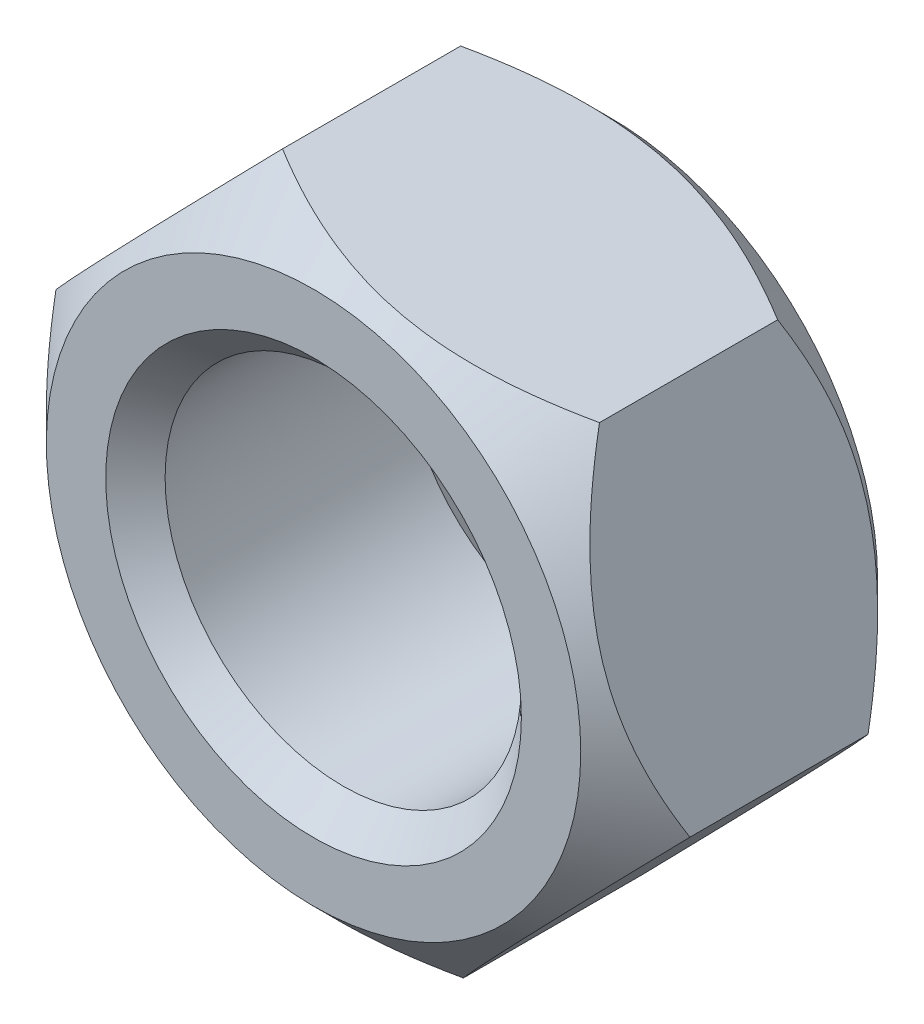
ISO-10303-21;
HEADER;
FILE_DESCRIPTION(('STEP AP214'),'2;1');
FILE_NAME('part.step','',(''),(''),'','','');
FILE_SCHEMA(('AUTOMOTIVE_DESIGN { 1 0 10303 214 1 1 1 1 }'));
ENDSEC;
DATA;
#1=APPLICATION_CONTEXT('core data for automotive mechanical design processes');
#2=APPLICATION_PROTOCOL_DEFINITION('international standard','automotive_design',2000,#1);
#3=PRODUCT_CONTEXT('',#1,'mechanical');
#4=PRODUCT('Part','Part','',(#3));
#5=PRODUCT_RELATED_PRODUCT_CATEGORY('part','',(#4));
#6=PRODUCT_DEFINITION_FORMATION('','',#4);
#7=PRODUCT_DEFINITION_CONTEXT('part definition',#1,'design');
#8=PRODUCT_DEFINITION('design','',#6,#7);
#9=PRODUCT_DEFINITION_SHAPE('','',#8);
#10=(LENGTH_UNIT() NAMED_UNIT(*) SI_UNIT(.MILLI.,.METRE.));
#11=(NAMED_UNIT(*) PLANE_ANGLE_UNIT() SI_UNIT($,.RADIAN.));
#12=(NAMED_UNIT(*) SI_UNIT($,.STERADIAN.) SOLID_ANGLE_UNIT());
#13=UNCERTAINTY_MEASURE_WITH_UNIT(LENGTH_MEASURE(1.E-05),#10,'distance_accuracy_value','');
#14=(GEOMETRIC_REPRESENTATION_CONTEXT(3) GLOBAL_UNCERTAINTY_ASSIGNED_CONTEXT((#13)) GLOBAL_UNIT_ASSIGNED_CONTEXT((#10,
#11,#12)) REPRESENTATION_CONTEXT('',''));
#15=CARTESIAN_POINT('',(0.,0.,0.));
#16=DIRECTION('',(0.,0.,1.));
#17=DIRECTION('',(1.,0.,0.));
#18=AXIS2_PLACEMENT_3D('',#15,#16,#17);
#19=CARTESIAN_POINT('',(0.,0.,5.));
#20=DIRECTION('',(0.,0.,1.));
#21=DIRECTION('',(1.,0.,0.));
#22=AXIS2_PLACEMENT_3D('',#19,#20,#21);
#23=PLANE('',#22);
#24=CARTESIAN_POINT('',(0.,0.,5.));
#25=DIRECTION('',(0.,0.,1.));
#26=DIRECTION('',(1.,0.,0.));
#27=AXIS2_PLACEMENT_3D('',#24,#25,#26);
#28=CIRCLE('',#27,3.50000000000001);
#29=CARTESIAN_POINT('',(3.50000000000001,0.,5.));
#30=VERTEX_POINT('',#29);
#31=EDGE_CURVE('E325',#30,#30,#28,.F.);
#32=ORIENTED_EDGE('',*,*,#31,.T.);
#33=EDGE_LOOP('',(#32));
#34=FACE_BOUND('',#33,.T.);
#35=CARTESIAN_POINT('',(0.,0.,5.));
#36=DIRECTION('',(0.,0.,1.));
#37=DIRECTION('',(1.,0.,0.));
#38=AXIS2_PLACEMENT_3D('',#35,#36,#37);
#39=CIRCLE('',#38,4.50000000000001);
#40=CARTESIAN_POINT('',(4.50000000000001,0.,5.));
#41=VERTEX_POINT('',#40);
#42=EDGE_CURVE('E116',#41,#41,#39,.T.);
#43=ORIENTED_EDGE('',*,*,#42,.T.);
#44=EDGE_LOOP('',(#43));
#45=FACE_BOUND('',#44,.T.);
#46=ADVANCED_FACE('F33',(#34,#45),#23,.T.);
#47=CARTESIAN_POINT('',(0.,0.,0.));
#48=DIRECTION('',(0.,0.,1.));
#49=DIRECTION('',(1.,0.,0.));
#50=AXIS2_PLACEMENT_3D('',#47,#48,#49);
#51=PLANE('',#50);
#52=CARTESIAN_POINT('',(0.,0.,0.));
#53=DIRECTION('',(0.,0.,1.));
#54=DIRECTION('',(1.,0.,0.));
#55=AXIS2_PLACEMENT_3D('',#52,#53,#54);
#56=CIRCLE('',#55,3.5);
#57=CARTESIAN_POINT('',(3.5,0.,0.));
#58=VERTEX_POINT('',#57);
#59=EDGE_CURVE('E46',#58,#58,#56,.T.);
#60=ORIENTED_EDGE('',*,*,#59,.T.);
#61=EDGE_LOOP('',(#60));
#62=FACE_BOUND('',#61,.T.);
#63=CARTESIAN_POINT('',(0.,0.,0.));
#64=DIRECTION('',(0.,0.,1.));
#65=DIRECTION('',(1.,0.,0.));
#66=AXIS2_PLACEMENT_3D('',#63,#64,#65);
#67=CIRCLE('',#66,4.5);
#68=CARTESIAN_POINT('',(4.5,0.,0.));
#69=VERTEX_POINT('',#68);
#70=EDGE_CURVE('E113',#69,#69,#67,.F.);
#71=ORIENTED_EDGE('',*,*,#70,.T.);
#72=EDGE_LOOP('',(#71));
#73=FACE_BOUND('',#72,.T.);
#74=ADVANCED_FACE('F137',(#62,#73),#51,.F.);
#75=CARTESIAN_POINT('',(0.,0.,5.));
#76=DIRECTION('',(0.,0.,-1.));
#77=DIRECTION('',(-1.,0.,0.));
#78=AXIS2_PLACEMENT_3D('',#75,#76,#77);
#79=CYLINDRICAL_SURFACE('',#78,3.);
#80=CARTESIAN_POINT('',(0.,0.,4.5));
#81=DIRECTION('',(0.,0.,1.));
#82=DIRECTION('',(1.,0.,0.));
#83=AXIS2_PLACEMENT_3D('',#80,#81,#82);
#84=CIRCLE('',#83,3.);
#85=CARTESIAN_POINT('',(3.,0.,4.5));
#86=VERTEX_POINT('',#85);
#87=EDGE_CURVE('E327',#86,#86,#84,.T.);
#88=ORIENTED_EDGE('',*,*,#87,.T.);
#89=EDGE_LOOP('',(#88));
#90=FACE_BOUND('',#89,.T.);
#91=CARTESIAN_POINT('',(0.,0.,0.500000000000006));
#92=DIRECTION('',(0.,0.,1.));
#93=DIRECTION('',(1.,0.,0.));
#94=AXIS2_PLACEMENT_3D('',#91,#92,#93);
#95=CIRCLE('',#94,3.);
#96=CARTESIAN_POINT('',(3.,0.,0.500000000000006));
#97=VERTEX_POINT('',#96);
#98=EDGE_CURVE('E324',#97,#97,#95,.F.);
#99=ORIENTED_EDGE('',*,*,#98,.T.);
#100=EDGE_LOOP('',(#99));
#101=FACE_BOUND('',#100,.T.);
#102=ADVANCED_FACE('F133',(#90,#101),#79,.F.);
#103=CARTESIAN_POINT('',(0.,0.,0.999999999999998));
#104=DIRECTION('',(0.,0.,1.));
#105=DIRECTION('',(1.,0.,0.));
#106=AXIS2_PLACEMENT_3D('',#103,#104,#105);
#107=CONICAL_SURFACE('',#106,5.5,0.78539816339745);
#108=CARTESIAN_POINT('',(-1.52271013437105,5.28516221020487,1.00014415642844));
#109=CARTESIAN_POINT('',(-1.52271258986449,5.28515966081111,1.00014238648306));
#110=CARTESIAN_POINT('',(-1.52271504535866,5.28515711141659,1.0001406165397));
#111=CARTESIAN_POINT('',(-1.65352527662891,5.14934457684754,0.90585150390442));
#112=CARTESIAN_POINT('',(-1.78640365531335,5.01138480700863,0.817315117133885));
#113=CARTESIAN_POINT('',(-2.05667600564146,4.73077699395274,0.655458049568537));
#114=CARTESIAN_POINT('',(-2.19407248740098,4.58812634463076,0.582145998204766));
#115=CARTESIAN_POINT('',(-2.47299281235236,4.29853985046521,0.455499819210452));
#116=CARTESIAN_POINT('',(-2.61450513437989,4.15161596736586,0.402114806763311));
#117=CARTESIAN_POINT('',(-2.82921866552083,3.92869159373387,0.340335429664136));
#118=CARTESIAN_POINT('',(-2.90117815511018,3.85398030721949,0.322794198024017));
#119=CARTESIAN_POINT('',(-3.04571296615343,3.70391835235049,0.29423996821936));
#120=CARTESIAN_POINT('',(-3.11828819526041,3.62856777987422,0.283226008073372));
#121=CARTESIAN_POINT('',(-3.29446119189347,3.44565776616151,0.264868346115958));
#122=CARTESIAN_POINT('',(-3.39824571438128,3.33790442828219,0.261026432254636));
#123=CARTESIAN_POINT('',(-3.60559009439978,3.12263100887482,0.267469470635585));
#124=CARTESIAN_POINT('',(-3.70914995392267,3.01511092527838,0.277754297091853));
#125=CARTESIAN_POINT('',(-3.91535768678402,2.80101761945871,0.311847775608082));
#126=CARTESIAN_POINT('',(-4.01800369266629,2.6944463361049,0.335679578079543));
#127=CARTESIAN_POINT('',(-4.22153557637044,2.48313120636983,0.395575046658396));
#128=CARTESIAN_POINT('',(-4.32242137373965,2.37838744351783,0.431639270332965));
#129=CARTESIAN_POINT('',(-4.58057298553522,2.11036387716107,0.538599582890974));
#130=CARTESIAN_POINT('',(-4.73623332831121,1.94875094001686,0.617522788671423));
#131=CARTESIAN_POINT('',(-5.04164745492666,1.63165749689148,0.795271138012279));
#132=CARTESIAN_POINT('',(-5.19140728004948,1.47617071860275,0.894075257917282));
#133=CARTESIAN_POINT('',(-5.33855506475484,1.32339586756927,1.0001406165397));
#134=CARTESIAN_POINT('',(-5.33855752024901,1.32339331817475,1.00014238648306));
#135=CARTESIAN_POINT('',(-5.33855997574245,1.32339076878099,1.00014415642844));
#136=B_SPLINE_CURVE_WITH_KNOTS('',3,(#108,#109,#110,#111,#112,#113,#114,#115,#116,#117,#118,
#119,#120,#121,#122,#123,#124,#125,#126,#127,#128,#129,#130,#131,#132,#133,#134,#135),
.UNSPECIFIED.,.F.,.F.,(4,2,2,2,2,2,2,2,2,2,2,2,2,4),(0.,1.18724079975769E-05,0.632472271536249,
1.26529018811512,1.89648093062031,2.21191086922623,2.52729430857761,2.9755633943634,
3.42382848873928,3.87286193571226,4.32191585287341,5.03411814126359,5.74557121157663,
5.74558308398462),.UNSPECIFIED.);
#137=CARTESIAN_POINT('',(-1.52291013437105,5.28495456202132,0.999999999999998));
#138=VERTEX_POINT('',#137);
#139=CARTESIAN_POINT('',(-5.33835997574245,1.32359841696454,0.999999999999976));
#140=VERTEX_POINT('',#139);
#141=EDGE_CURVE('E90',#138,#140,#136,.T.);
#142=ORIENTED_EDGE('',*,*,#141,.F.);
#143=CARTESIAN_POINT('',(3.81564984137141,3.96130655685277,1.00010303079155));
#144=CARTESIAN_POINT('',(3.72385953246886,3.98406513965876,0.952822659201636));
#145=CARTESIAN_POINT('',(3.63136367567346,4.00699865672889,0.906993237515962));
#146=CARTESIAN_POINT('',(3.44482244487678,4.05324987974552,0.818677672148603));
#147=CARTESIAN_POINT('',(3.35077625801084,4.07656778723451,0.776193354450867));
#148=CARTESIAN_POINT('',(3.06523083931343,4.14736620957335,0.654057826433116));
#149=CARTESIAN_POINT('',(2.87131430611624,4.19544607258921,0.580245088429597));
#150=CARTESIAN_POINT('',(2.48026609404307,4.29240296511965,0.453845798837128));
#151=CARTESIAN_POINT('',(2.28323436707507,4.34125521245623,0.400940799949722));
#152=CARTESIAN_POINT('',(1.98444746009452,4.41533674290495,0.33974266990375));
#153=CARTESIAN_POINT('',(1.88441192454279,4.44013965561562,0.322378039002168));
#154=CARTESIAN_POINT('',(1.6834938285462,4.48995549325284,0.294094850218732));
#155=CARTESIAN_POINT('',(1.58261139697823,4.51496838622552,0.283175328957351));
#156=CARTESIAN_POINT('',(1.33677615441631,4.57592102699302,0.264867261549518));
#157=CARTESIAN_POINT('',(1.19155846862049,4.61192644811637,0.261025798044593));
#158=CARTESIAN_POINT('',(0.901384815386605,4.68387239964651,0.267472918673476));
#159=CARTESIAN_POINT('',(0.756428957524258,4.71981290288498,0.27776645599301));
#160=CARTESIAN_POINT('',(0.46788384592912,4.79135507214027,0.311876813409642));
#161=CARTESIAN_POINT('',(0.324296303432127,4.82695631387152,0.335708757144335));
#162=CARTESIAN_POINT('',(0.0395891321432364,4.89754690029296,0.395600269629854));
#163=CARTESIAN_POINT('',(-0.101530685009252,4.93253629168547,0.431658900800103));
#164=CARTESIAN_POINT('',(-0.352046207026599,4.99464936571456,0.505843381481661));
#165=CARTESIAN_POINT('',(-0.461996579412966,5.02191057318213,0.542018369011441));
#166=CARTESIAN_POINT('',(-0.679923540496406,5.07594360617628,0.620197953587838));
#167=CARTESIAN_POINT('',(-0.78790006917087,5.1027154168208,0.662202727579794));
#168=CARTESIAN_POINT('',(-1.00153925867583,5.15568533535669,0.751100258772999));
#169=CARTESIAN_POINT('',(-1.10720799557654,5.18188494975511,0.797977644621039));
#170=CARTESIAN_POINT('',(-1.3165887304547,5.23379902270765,0.896004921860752));
#171=CARTESIAN_POINT('',(-1.42030188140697,5.25951376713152,0.947152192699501));
#172=CARTESIAN_POINT('',(-1.52311013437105,5.2850041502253,1.00010303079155));
#173=B_SPLINE_CURVE_WITH_KNOTS('',3,(#143,#144,#145,#146,#147,#148,#149,#150,#151,#152,#153,
#154,#155,#156,#157,#158,#159,#160,#161,#162,#163,#164,#165,#166,#167,#168,#169,#170,#171,#172),
.UNSPECIFIED.,.F.,.F.,(4,2,2,2,2,2,2,2,2,2,2,2,2,2,4),(0.,0.317171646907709,0.634515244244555,
1.27262866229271,1.90060920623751,2.21398358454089,2.52731110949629,2.9756055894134,
3.42405720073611,3.87301076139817,4.32192990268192,4.67850890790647,5.03509873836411,
5.3905959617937,5.74587658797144),.UNSPECIFIED.);
#174=CARTESIAN_POINT('',(3.81544984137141,3.96135614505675,1.00000000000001));
#175=VERTEX_POINT('',#174);
#176=EDGE_CURVE('E197',#175,#138,#173,.T.);
#177=ORIENTED_EDGE('',*,*,#176,.F.);
#178=CARTESIAN_POINT('',(5.33841760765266,-1.32379841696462,1.00010407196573));
#179=CARTESIAN_POINT('',(5.31223194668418,-1.2329263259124,0.952823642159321));
#180=CARTESIAN_POINT('',(5.28584500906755,-1.14135574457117,0.9069941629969));
#181=CARTESIAN_POINT('',(5.23262909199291,-0.956680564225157,0.818678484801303));
#182=CARTESIAN_POINT('',(5.2057998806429,-0.863575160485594,0.776194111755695));
#183=CARTESIAN_POINT('',(5.12434034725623,-0.580886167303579,0.654058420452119));
#184=CARTESIAN_POINT('',(5.06902042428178,-0.388909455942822,0.580245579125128));
#185=CARTESIAN_POINT('',(4.95746337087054,-0.00177304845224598,0.453846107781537));
#186=CARTESIAN_POINT('',(4.9012547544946,0.193287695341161,0.400941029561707));
#187=CARTESIAN_POINT('',(4.81601772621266,0.489085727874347,0.339742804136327));
#188=CARTESIAN_POINT('',(4.78747988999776,0.588120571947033,0.322378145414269));
#189=CARTESIAN_POINT('',(4.73016258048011,0.787028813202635,0.294094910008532));
#190=CARTESIAN_POINT('',(4.70138314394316,0.886902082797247,0.283175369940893));
#191=CARTESIAN_POINT('',(4.63125203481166,1.13027804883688,0.264867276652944));
#192=CARTESIAN_POINT('',(4.58982479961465,1.2740429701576,0.261025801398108));
#193=CARTESIAN_POINT('',(4.50704499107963,1.56131371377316,0.267472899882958));
#194=CARTESIAN_POINT('',(4.46569244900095,1.70481942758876,0.27776642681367));
#195=CARTESIAN_POINT('',(4.38337722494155,1.99047792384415,0.311876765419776));
#196=CARTESIAN_POINT('',(4.34241503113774,2.13262901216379,0.33570870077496));
#197=CARTESIAN_POINT('',(4.26119468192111,2.41448796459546,0.395600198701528));
#198=CARTESIAN_POINT('',(4.2209364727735,2.55419601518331,0.431658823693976));
#199=CARTESIAN_POINT('',(4.14947015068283,2.80220557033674,0.505843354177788));
#200=CARTESIAN_POINT('',(4.11810380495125,2.9110561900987,0.542018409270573));
#201=CARTESIAN_POINT('',(4.05593419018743,3.12680338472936,0.620198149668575));
#202=CARTESIAN_POINT('',(4.02513093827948,3.23369990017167,0.662203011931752));
#203=CARTESIAN_POINT('',(3.96418452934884,3.44520220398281,0.751100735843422));
#204=CARTESIAN_POINT('',(3.93403963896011,3.54981400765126,0.797978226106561));
#205=CARTESIAN_POINT('',(3.87430807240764,3.75710044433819,0.896005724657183));
#206=CARTESIAN_POINT('',(3.84472106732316,3.85977621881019,0.947153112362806));
#207=CARTESIAN_POINT('',(3.81539220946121,3.96155614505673,1.00010407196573));
#208=B_SPLINE_CURVE_WITH_KNOTS('',3,(#178,#179,#180,#181,#182,#183,#184,#185,#186,#187,#188,
#189,#190,#191,#192,#193,#194,#195,#196,#197,#198,#199,#200,#201,#202,#203,#204,#205,#206,#207),
.UNSPECIFIED.,.F.,.F.,(4,2,2,2,2,2,2,2,2,2,2,2,2,2,4),(0.,0.317171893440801,0.634515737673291,
1.27262966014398,1.90061068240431,2.21398529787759,2.5273130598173,2.9756075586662,
3.42405918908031,3.87301277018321,4.32193193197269,4.67851159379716,5.03510208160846,
5.39059996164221,5.74588124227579),.UNSPECIFIED.);
#209=CARTESIAN_POINT('',(5.33835997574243,-1.32359841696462,0.999999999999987));
#210=VERTEX_POINT('',#209);
#211=EDGE_CURVE('E215',#210,#175,#208,.T.);
#212=ORIENTED_EDGE('',*,*,#211,.F.);
#213=CARTESIAN_POINT('',(1.52271013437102,-5.28516221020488,1.00014415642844));
#214=CARTESIAN_POINT('',(1.52271258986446,-5.28515966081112,1.00014238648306));
#215=CARTESIAN_POINT('',(1.52271504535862,-5.2851571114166,1.0001406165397));
#216=CARTESIAN_POINT('',(1.65352527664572,-5.14934457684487,0.90585150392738));
#217=CARTESIAN_POINT('',(1.78640365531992,-5.01138480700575,0.817315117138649));
#218=CARTESIAN_POINT('',(2.05667600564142,-4.73077699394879,0.655458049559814));
#219=CARTESIAN_POINT('',(2.19407248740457,-4.58812634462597,0.582145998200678));
#220=CARTESIAN_POINT('',(2.4729928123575,-4.2985398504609,0.455499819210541));
#221=CARTESIAN_POINT('',(2.6145051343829,-4.15161596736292,0.40211480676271));
#222=CARTESIAN_POINT('',(2.82921866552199,-3.92869159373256,0.34033542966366));
#223=CARTESIAN_POINT('',(2.90117815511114,-3.85398030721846,0.322794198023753));
#224=CARTESIAN_POINT('',(3.04571296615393,-3.70391835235,0.294239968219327));
#225=CARTESIAN_POINT('',(3.11828819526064,-3.62856777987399,0.28322600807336));
#226=CARTESIAN_POINT('',(3.294461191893,-3.44565776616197,0.264868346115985));
#227=CARTESIAN_POINT('',(3.3982457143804,-3.33790442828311,0.261026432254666));
#228=CARTESIAN_POINT('',(3.60559009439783,-3.12263100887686,0.26746947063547));
#229=CARTESIAN_POINT('',(3.70914995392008,-3.01511092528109,0.277754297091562));
#230=CARTESIAN_POINT('',(3.9153576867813,-2.80101761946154,0.311847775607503));
#231=CARTESIAN_POINT('',(4.01800369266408,-2.6944463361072,0.335679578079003));
#232=CARTESIAN_POINT('',(4.22153557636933,-2.483131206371,0.395575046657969));
#233=CARTESIAN_POINT('',(4.32242137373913,-2.37838744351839,0.431639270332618));
#234=CARTESIAN_POINT('',(4.58057298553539,-2.11036387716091,0.538599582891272));
#235=CARTESIAN_POINT('',(4.73623332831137,-1.9487509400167,0.61752278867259));
#236=CARTESIAN_POINT('',(5.04164745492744,-1.63165749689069,0.795271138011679));
#237=CARTESIAN_POINT('',(5.1914072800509,-1.47617071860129,0.894075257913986));
#238=CARTESIAN_POINT('',(5.33855506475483,-1.32339586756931,1.00014061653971));
#239=CARTESIAN_POINT('',(5.338557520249,-1.32339331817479,1.00014238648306));
#240=CARTESIAN_POINT('',(5.33855997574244,-1.32339076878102,1.00014415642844));
#241=B_SPLINE_CURVE_WITH_KNOTS('',3,(#213,#214,#215,#216,#217,#218,#219,#220,#221,#222,#223,
#224,#225,#226,#227,#228,#229,#230,#231,#232,#233,#234,#235,#236,#237,#238,#239,#240),
.UNSPECIFIED.,.F.,.F.,(4,2,2,2,2,2,2,2,2,2,2,2,2,4),(0.,1.18724079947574E-05,0.632472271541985,
1.26529018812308,1.8964809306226,2.21191086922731,2.52729430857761,2.97556339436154,
3.42382848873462,3.87286193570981,4.32191585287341,5.03411814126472,5.74557121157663,
5.74558308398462),.UNSPECIFIED.);
#242=CARTESIAN_POINT('',(1.52291013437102,-5.28495456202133,1.));
#243=VERTEX_POINT('',#242);
#244=EDGE_CURVE('E225',#243,#210,#241,.T.);
#245=ORIENTED_EDGE('',*,*,#244,.F.);
#246=CARTESIAN_POINT('',(-3.81564984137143,-3.96130655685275,1.00010303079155));
#247=CARTESIAN_POINT('',(-3.72385953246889,-3.98406513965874,0.952822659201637));
#248=CARTESIAN_POINT('',(-3.63136367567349,-4.00699865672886,0.906993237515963));
#249=CARTESIAN_POINT('',(-3.44482244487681,-4.05324987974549,0.818677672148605));
#250=CARTESIAN_POINT('',(-3.35077625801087,-4.07656778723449,0.776193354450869));
#251=CARTESIAN_POINT('',(-3.06523083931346,-4.14736620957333,0.654057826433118));
#252=CARTESIAN_POINT('',(-2.87131430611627,-4.19544607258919,0.580245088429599));
#253=CARTESIAN_POINT('',(-2.48026609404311,-4.29240296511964,0.45384579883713));
#254=CARTESIAN_POINT('',(-2.2832343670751,-4.34125521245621,0.400940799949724));
#255=CARTESIAN_POINT('',(-1.98444746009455,-4.41533674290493,0.339742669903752));
#256=CARTESIAN_POINT('',(-1.88441192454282,-4.44013965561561,0.322378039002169));
#257=CARTESIAN_POINT('',(-1.68349382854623,-4.48995549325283,0.294094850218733));
#258=CARTESIAN_POINT('',(-1.58261139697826,-4.51496838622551,0.283175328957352));
#259=CARTESIAN_POINT('',(-1.33677615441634,-4.57592102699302,0.264867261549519));
#260=CARTESIAN_POINT('',(-1.19155846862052,-4.61192644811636,0.261025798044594));
#261=CARTESIAN_POINT('',(-0.901384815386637,-4.6838723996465,0.267472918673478));
#262=CARTESIAN_POINT('',(-0.75642895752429,-4.71981290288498,0.277766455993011));
#263=CARTESIAN_POINT('',(-0.467883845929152,-4.79135507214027,0.311876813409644));
#264=CARTESIAN_POINT('',(-0.324296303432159,-4.82695631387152,0.335708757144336));
#265=CARTESIAN_POINT('',(-0.0395891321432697,-4.89754690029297,0.395600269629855));
#266=CARTESIAN_POINT('',(0.101530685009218,-4.93253629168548,0.431658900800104));
#267=CARTESIAN_POINT('',(0.352046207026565,-4.99464936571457,0.505843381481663));
#268=CARTESIAN_POINT('',(0.461996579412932,-5.02191057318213,0.542018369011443));
#269=CARTESIAN_POINT('',(0.679923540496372,-5.07594360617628,0.62019795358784));
#270=CARTESIAN_POINT('',(0.787900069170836,-5.1027154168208,0.662202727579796));
#271=CARTESIAN_POINT('',(1.0015392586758,-5.1556853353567,0.751100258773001));
#272=CARTESIAN_POINT('',(1.1072079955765,-5.18188494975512,0.79797764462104));
#273=CARTESIAN_POINT('',(1.31658873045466,-5.23379902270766,0.896004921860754));
#274=CARTESIAN_POINT('',(1.42030188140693,-5.25951376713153,0.947152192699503));
#275=CARTESIAN_POINT('',(1.52311013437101,-5.28500415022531,1.00010303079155));
#276=B_SPLINE_CURVE_WITH_KNOTS('',3,(#246,#247,#248,#249,#250,#251,#252,#253,#254,#255,#256,
#257,#258,#259,#260,#261,#262,#263,#264,#265,#266,#267,#268,#269,#270,#271,#272,#273,#274,#275),
.UNSPECIFIED.,.F.,.F.,(4,2,2,2,2,2,2,2,2,2,2,2,2,2,4),(0.,0.317171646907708,0.634515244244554,
1.27262866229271,1.90060920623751,2.21398358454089,2.52731110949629,2.9756055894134,
3.42405720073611,3.87301076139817,4.32192990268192,4.67850890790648,5.03509873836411,
5.3905959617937,5.74587658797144),.UNSPECIFIED.);
#277=CARTESIAN_POINT('',(-3.81544984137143,-3.96135614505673,0.999999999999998));
#278=VERTEX_POINT('',#277);
#279=EDGE_CURVE('E112',#278,#243,#276,.T.);
#280=ORIENTED_EDGE('',*,*,#279,.F.);
#281=CARTESIAN_POINT('',(-5.33841760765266,1.32379841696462,1.00010407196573));
#282=CARTESIAN_POINT('',(-5.31223194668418,1.2329263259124,0.952823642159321));
#283=CARTESIAN_POINT('',(-5.28584500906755,1.14135574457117,0.9069941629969));
#284=CARTESIAN_POINT('',(-5.23262909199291,0.956680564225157,0.818678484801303));
#285=CARTESIAN_POINT('',(-5.2057998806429,0.863575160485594,0.776194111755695));
#286=CARTESIAN_POINT('',(-5.12434034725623,0.580886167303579,0.654058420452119));
#287=CARTESIAN_POINT('',(-5.06902042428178,0.388909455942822,0.580245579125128));
#288=CARTESIAN_POINT('',(-4.95746337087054,0.00177304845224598,0.453846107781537));
#289=CARTESIAN_POINT('',(-4.9012547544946,-0.193287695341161,0.400941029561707));
#290=CARTESIAN_POINT('',(-4.81601772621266,-0.489085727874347,0.339742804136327));
#291=CARTESIAN_POINT('',(-4.78747988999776,-0.588120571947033,0.322378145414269));
#292=CARTESIAN_POINT('',(-4.73016258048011,-0.787028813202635,0.294094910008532));
#293=CARTESIAN_POINT('',(-4.70138314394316,-0.886902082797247,0.283175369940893));
#294=CARTESIAN_POINT('',(-4.63125203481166,-1.13027804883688,0.264867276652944));
#295=CARTESIAN_POINT('',(-4.58982479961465,-1.2740429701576,0.261025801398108));
#296=CARTESIAN_POINT('',(-4.50704499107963,-1.56131371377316,0.267472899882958));
#297=CARTESIAN_POINT('',(-4.46569244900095,-1.70481942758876,0.27776642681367));
#298=CARTESIAN_POINT('',(-4.38337722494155,-1.99047792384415,0.311876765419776));
#299=CARTESIAN_POINT('',(-4.34241503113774,-2.13262901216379,0.33570870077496));
#300=CARTESIAN_POINT('',(-4.26119468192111,-2.41448796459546,0.395600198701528));
#301=CARTESIAN_POINT('',(-4.2209364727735,-2.55419601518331,0.431658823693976));
#302=CARTESIAN_POINT('',(-4.14947015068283,-2.80220557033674,0.505843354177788));
#303=CARTESIAN_POINT('',(-4.11810380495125,-2.9110561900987,0.542018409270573));
#304=CARTESIAN_POINT('',(-4.05593419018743,-3.12680338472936,0.620198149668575));
#305=CARTESIAN_POINT('',(-4.02513093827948,-3.23369990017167,0.662203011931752));
#306=CARTESIAN_POINT('',(-3.96418452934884,-3.44520220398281,0.751100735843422));
#307=CARTESIAN_POINT('',(-3.93403963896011,-3.54981400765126,0.797978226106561));
#308=CARTESIAN_POINT('',(-3.87430807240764,-3.75710044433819,0.896005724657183));
#309=CARTESIAN_POINT('',(-3.84472106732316,-3.85977621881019,0.947153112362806));
#310=CARTESIAN_POINT('',(-3.81539220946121,-3.96155614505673,1.00010407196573));
#311=B_SPLINE_CURVE_WITH_KNOTS('',3,(#281,#282,#283,#284,#285,#286,#287,#288,#289,#290,#291,
#292,#293,#294,#295,#296,#297,#298,#299,#300,#301,#302,#303,#304,#305,#306,#307,#308,#309,#310),
.UNSPECIFIED.,.F.,.F.,(4,2,2,2,2,2,2,2,2,2,2,2,2,2,4),(0.,0.317171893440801,0.634515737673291,
1.27262966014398,1.90061068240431,2.21398529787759,2.5273130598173,2.9756075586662,
3.42405918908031,3.87301277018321,4.32193193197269,4.67851159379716,5.03510208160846,
5.39059996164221,5.74588124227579),.UNSPECIFIED.);
#312=EDGE_CURVE('E106',#140,#278,#311,.T.);
#313=ORIENTED_EDGE('',*,*,#312,.F.);
#314=EDGE_LOOP('',(#142,#177,#212,#245,#280,#313));
#315=FACE_BOUND('',#314,.T.);
#316=ORIENTED_EDGE('',*,*,#70,.F.);
#317=EDGE_LOOP('',(#316));
#318=FACE_BOUND('',#317,.T.);
#319=ADVANCED_FACE('F109',(#315,#318),#107,.T.);
#320=CARTESIAN_POINT('',(0.,0.,5.));
#321=DIRECTION('',(0.,0.,-1.));
#322=DIRECTION('',(-1.,0.,0.));
#323=AXIS2_PLACEMENT_3D('',#320,#321,#322);
#324=CONICAL_SURFACE('',#323,4.50000000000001,0.785398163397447);
#325=CARTESIAN_POINT('',(-5.33855997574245,1.32339076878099,3.99985584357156));
#326=CARTESIAN_POINT('',(-5.33855752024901,1.32339331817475,3.99985761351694));
#327=CARTESIAN_POINT('',(-5.33855506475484,1.32339586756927,3.9998593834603));
#328=CARTESIAN_POINT('',(-5.20774483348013,1.4592084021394,4.09414849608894));
#329=CARTESIAN_POINT('',(-5.07486645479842,1.59716817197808,4.1826848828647));
#330=CARTESIAN_POINT('',(-4.80459410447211,1.87777598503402,4.34454195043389));
#331=CARTESIAN_POINT('',(-4.66719762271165,2.02042663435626,4.41785400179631));
#332=CARTESIAN_POINT('',(-4.38827729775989,2.31001312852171,4.54450018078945));
#333=CARTESIAN_POINT('',(-4.24676497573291,2.45693701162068,4.59788519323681));
#334=CARTESIAN_POINT('',(-4.03205144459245,2.67986138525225,4.65966457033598));
#335=CARTESIAN_POINT('',(-3.96009195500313,2.75457267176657,4.67720580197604));
#336=CARTESIAN_POINT('',(-3.81555714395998,2.90463462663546,4.70576003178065));
#337=CARTESIAN_POINT('',(-3.74298191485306,2.97998519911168,4.71677399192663));
#338=CARTESIAN_POINT('',(-3.56680891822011,3.16289521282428,4.73513165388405));
#339=CARTESIAN_POINT('',(-3.46302439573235,3.27064855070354,4.73897356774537));
#340=CARTESIAN_POINT('',(-3.25568001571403,3.48592197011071,4.73253052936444));
#341=CARTESIAN_POINT('',(-3.15212015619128,3.59344205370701,4.72224570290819));
#342=CARTESIAN_POINT('',(-2.94591242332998,3.80753535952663,4.68815222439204));
#343=CARTESIAN_POINT('',(-2.84326641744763,3.91410664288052,4.6643204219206));
#344=CARTESIAN_POINT('',(-2.63973453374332,4.12542177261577,4.60442495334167));
#345=CARTESIAN_POINT('',(-2.53884873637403,4.23016553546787,4.56836072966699));
#346=CARTESIAN_POINT('',(-2.28069712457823,4.49818910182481,4.4614004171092));
#347=CARTESIAN_POINT('',(-2.12503678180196,4.65980203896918,4.38247721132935));
#348=CARTESIAN_POINT('',(-1.8196226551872,4.97689548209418,4.20472886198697));
#349=CARTESIAN_POINT('',(-1.66986283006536,5.13238226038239,4.10592474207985));
#350=CARTESIAN_POINT('',(-1.52271504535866,5.28515711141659,3.9998593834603));
#351=CARTESIAN_POINT('',(-1.52271258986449,5.28515966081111,3.99985761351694));
#352=CARTESIAN_POINT('',(-1.52271013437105,5.28516221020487,3.99985584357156));
#353=B_SPLINE_CURVE_WITH_KNOTS('',3,(#325,#326,#327,#328,#329,#330,#331,#332,#333,#334,#335,
#336,#337,#338,#339,#340,#341,#342,#343,#344,#345,#346,#347,#348,#349,#350,#351,#352),
.UNSPECIFIED.,.F.,.F.,(4,2,2,2,2,2,2,2,2,2,2,2,2,4),(0.,1.18724079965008E-05,0.632472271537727,
1.26529018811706,1.89648093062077,2.21191086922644,2.52729430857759,2.97556339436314,
3.42382848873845,3.87286193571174,4.32191585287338,5.03411814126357,5.74557121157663,
5.74558308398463),.UNSPECIFIED.);
#354=CARTESIAN_POINT('',(-5.33835997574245,1.32359841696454,4.00000000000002));
#355=VERTEX_POINT('',#354);
#356=CARTESIAN_POINT('',(-1.52291013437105,5.28495456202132,4.));
#357=VERTEX_POINT('',#356);
#358=EDGE_CURVE('E101',#355,#357,#353,.T.);
#359=ORIENTED_EDGE('',*,*,#358,.F.);
#360=CARTESIAN_POINT('',(-3.81539220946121,-3.96155614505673,3.99989592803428));
#361=CARTESIAN_POINT('',(-3.84157787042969,-3.87068405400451,4.04717635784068));
#362=CARTESIAN_POINT('',(-3.86796480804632,-3.77911347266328,4.0930058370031));
#363=CARTESIAN_POINT('',(-3.92118072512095,-3.59443829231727,4.1813215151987));
#364=CARTESIAN_POINT('',(-3.94800993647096,-3.50133288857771,4.22380588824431));
#365=CARTESIAN_POINT('',(-4.02946946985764,-3.21864389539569,4.34594157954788));
#366=CARTESIAN_POINT('',(-4.08478939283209,-3.02666718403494,4.41975442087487));
#367=CARTESIAN_POINT('',(-4.19634644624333,-2.63953077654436,4.54615389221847));
#368=CARTESIAN_POINT('',(-4.25255506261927,-2.44447003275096,4.5990589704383));
#369=CARTESIAN_POINT('',(-4.33779209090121,-2.14867200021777,4.66025719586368));
#370=CARTESIAN_POINT('',(-4.36632992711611,-2.04963715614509,4.67762185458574));
#371=CARTESIAN_POINT('',(-4.42364723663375,-1.85072891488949,4.70590508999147));
#372=CARTESIAN_POINT('',(-4.45242667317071,-1.75085564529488,4.71682463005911));
#373=CARTESIAN_POINT('',(-4.5225577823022,-1.50747967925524,4.73513272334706));
#374=CARTESIAN_POINT('',(-4.56398501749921,-1.36371475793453,4.7389741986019));
#375=CARTESIAN_POINT('',(-4.64676482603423,-1.07644401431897,4.73252710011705));
#376=CARTESIAN_POINT('',(-4.68811736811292,-0.932938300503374,4.72223357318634));
#377=CARTESIAN_POINT('',(-4.77043259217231,-0.647279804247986,4.68812323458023));
#378=CARTESIAN_POINT('',(-4.81139478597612,-0.505128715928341,4.66429129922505));
#379=CARTESIAN_POINT('',(-4.89261513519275,-0.223269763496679,4.60439980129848));
#380=CARTESIAN_POINT('',(-4.93287334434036,-0.0835617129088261,4.56834117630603));
#381=CARTESIAN_POINT('',(-5.00433966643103,0.164447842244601,4.49415664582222));
#382=CARTESIAN_POINT('',(-5.03570601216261,0.273298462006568,4.45798159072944));
#383=CARTESIAN_POINT('',(-5.09787562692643,0.489045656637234,4.37980185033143));
#384=CARTESIAN_POINT('',(-5.12867887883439,0.595942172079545,4.33779698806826));
#385=CARTESIAN_POINT('',(-5.18962528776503,0.80744447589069,4.24889926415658));
#386=CARTESIAN_POINT('',(-5.21977017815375,0.912056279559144,4.20202177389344));
#387=CARTESIAN_POINT('',(-5.27950174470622,1.11934271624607,4.10399427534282));
#388=CARTESIAN_POINT('',(-5.30908874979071,1.22201849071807,4.05284688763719));
#389=CARTESIAN_POINT('',(-5.33841760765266,1.32379841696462,3.99989592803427));
#390=B_SPLINE_CURVE_WITH_KNOTS('',3,(#360,#361,#362,#363,#364,#365,#366,#367,#368,#369,#370,
#371,#372,#373,#374,#375,#376,#377,#378,#379,#380,#381,#382,#383,#384,#385,#386,#387,#388,#389),
.UNSPECIFIED.,.F.,.F.,(4,2,2,2,2,2,2,2,2,2,2,2,2,2,4),(0.,0.3171718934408,0.634515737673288,
1.27262966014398,1.9006106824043,2.21398529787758,2.52731305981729,2.97560755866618,
3.42405918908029,3.87301277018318,4.32193193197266,4.67851159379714,5.03510208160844,
5.39059996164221,5.74588124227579),.UNSPECIFIED.);
#391=CARTESIAN_POINT('',(-3.81544984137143,-3.96135614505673,4.));
#392=VERTEX_POINT('',#391);
#393=EDGE_CURVE('E11',#392,#355,#390,.T.);
#394=ORIENTED_EDGE('',*,*,#393,.F.);
#395=CARTESIAN_POINT('',(1.52311013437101,-5.28500415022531,3.99989696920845));
#396=CARTESIAN_POINT('',(1.43131982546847,-5.26224556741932,4.04717734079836));
#397=CARTESIAN_POINT('',(1.33882396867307,-5.23931205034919,4.09300676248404));
#398=CARTESIAN_POINT('',(1.15228273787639,-5.19306082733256,4.1813223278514));
#399=CARTESIAN_POINT('',(1.05823655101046,-5.16974291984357,4.22380664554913));
#400=CARTESIAN_POINT('',(0.772691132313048,-5.09894449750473,4.34594217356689));
#401=CARTESIAN_POINT('',(0.578774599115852,-5.05086463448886,4.4197549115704));
#402=CARTESIAN_POINT('',(0.187726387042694,-4.95390774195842,4.54615420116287));
#403=CARTESIAN_POINT('',(-0.0093053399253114,-4.90505549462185,4.59905920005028));
#404=CARTESIAN_POINT('',(-0.308092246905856,-4.83097396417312,4.66025733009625));
#405=CARTESIAN_POINT('',(-0.408127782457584,-4.80617105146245,4.67762196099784));
#406=CARTESIAN_POINT('',(-0.609045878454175,-4.75635521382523,4.70590514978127));
#407=CARTESIAN_POINT('',(-0.709928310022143,-4.73134232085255,4.71682467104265));
#408=CARTESIAN_POINT('',(-0.95576355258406,-4.67038968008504,4.73513273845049));
#409=CARTESIAN_POINT('',(-1.10098123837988,-4.6343842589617,4.73897420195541));
#410=CARTESIAN_POINT('',(-1.39115489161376,-4.56243830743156,4.73252708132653));
#411=CARTESIAN_POINT('',(-1.53611074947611,-4.52649780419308,4.722233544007));
#412=CARTESIAN_POINT('',(-1.82465586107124,-4.4549556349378,4.68812318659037));
#413=CARTESIAN_POINT('',(-1.96824340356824,-4.41935439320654,4.66429124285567));
#414=CARTESIAN_POINT('',(-2.25295057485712,-4.3487638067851,4.60439973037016));
#415=CARTESIAN_POINT('',(-2.39407039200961,-4.31377441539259,4.56834109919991));
#416=CARTESIAN_POINT('',(-2.64458591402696,-4.2516613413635,4.49415661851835));
#417=CARTESIAN_POINT('',(-2.75453628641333,-4.22440013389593,4.45798163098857));
#418=CARTESIAN_POINT('',(-2.97246324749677,-4.17036710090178,4.37980204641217));
#419=CARTESIAN_POINT('',(-3.08043977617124,-4.14359529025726,4.33779727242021));
#420=CARTESIAN_POINT('',(-3.29407896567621,-4.09062537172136,4.24889974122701));
#421=CARTESIAN_POINT('',(-3.39974770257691,-4.06442575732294,4.20202235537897));
#422=CARTESIAN_POINT('',(-3.60912843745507,-4.0125116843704,4.10399507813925));
#423=CARTESIAN_POINT('',(-3.71284158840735,-3.98679693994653,4.0528478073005));
#424=CARTESIAN_POINT('',(-3.81564984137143,-3.96130655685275,3.99989696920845));
#425=B_SPLINE_CURVE_WITH_KNOTS('',3,(#395,#396,#397,#398,#399,#400,#401,#402,#403,#404,#405,
#406,#407,#408,#409,#410,#411,#412,#413,#414,#415,#416,#417,#418,#419,#420,#421,#422,#423,#424),
.UNSPECIFIED.,.F.,.F.,(4,2,2,2,2,2,2,2,2,2,2,2,2,2,4),(0.,0.317171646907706,0.634515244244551,
1.27262866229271,1.9006092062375,2.21398358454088,2.52731110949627,2.97560558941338,
3.42405720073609,3.87301076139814,4.32192990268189,4.67850890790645,5.03509873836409,
5.39059596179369,5.74587658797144),.UNSPECIFIED.);
#426=CARTESIAN_POINT('',(1.52291013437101,-5.28495456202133,4.));
#427=VERTEX_POINT('',#426);
#428=EDGE_CURVE('E53',#427,#392,#425,.T.);
#429=ORIENTED_EDGE('',*,*,#428,.F.);
#430=CARTESIAN_POINT('',(5.33855997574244,-1.32339076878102,3.99985584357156));
#431=CARTESIAN_POINT('',(5.338557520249,-1.32339331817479,3.99985761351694));
#432=CARTESIAN_POINT('',(5.33855506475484,-1.3233958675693,3.9998593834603));
#433=CARTESIAN_POINT('',(5.20774483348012,-1.45920840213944,4.09414849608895));
#434=CARTESIAN_POINT('',(5.07486645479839,-1.59716817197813,4.18268488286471));
#435=CARTESIAN_POINT('',(4.80459410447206,-1.87777598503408,4.34454195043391));
#436=CARTESIAN_POINT('',(4.6671976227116,-2.02042663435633,4.41785400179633));
#437=CARTESIAN_POINT('',(4.38827729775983,-2.31001312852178,4.54450018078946));
#438=CARTESIAN_POINT('',(4.24676497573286,-2.45693701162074,4.59788519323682));
#439=CARTESIAN_POINT('',(4.03205144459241,-2.6798613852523,4.65966457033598));
#440=CARTESIAN_POINT('',(3.9600919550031,-2.75457267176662,4.67720580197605));
#441=CARTESIAN_POINT('',(3.81555714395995,-2.9046346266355,4.70576003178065));
#442=CARTESIAN_POINT('',(3.74298191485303,-2.97998519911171,4.71677399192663));
#443=CARTESIAN_POINT('',(3.5668089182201,-3.1628952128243,4.73513165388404));
#444=CARTESIAN_POINT('',(3.46302439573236,-3.27064855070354,4.73897356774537));
#445=CARTESIAN_POINT('',(3.25568001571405,-3.48592197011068,4.73253052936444));
#446=CARTESIAN_POINT('',(3.15212015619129,-3.59344205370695,4.7222457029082));
#447=CARTESIAN_POINT('',(2.94591242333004,-3.80753535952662,4.68815222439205));
#448=CARTESIAN_POINT('',(2.84326641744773,-3.91410664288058,4.66432042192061));
#449=CARTESIAN_POINT('',(2.63973453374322,-4.12542177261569,4.60442495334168));
#450=CARTESIAN_POINT('',(2.53884873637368,-4.23016553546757,4.56836072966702));
#451=CARTESIAN_POINT('',(2.28069712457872,-4.49818910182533,4.46140041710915));
#452=CARTESIAN_POINT('',(2.12503678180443,-4.65980203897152,4.38247721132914));
#453=CARTESIAN_POINT('',(1.81962265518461,-4.97689548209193,4.20472886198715));
#454=CARTESIAN_POINT('',(1.66986283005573,-5.13238226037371,4.10592474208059));
#455=CARTESIAN_POINT('',(1.52271504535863,-5.2851571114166,3.99985938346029));
#456=CARTESIAN_POINT('',(1.52271258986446,-5.28515966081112,3.99985761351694));
#457=CARTESIAN_POINT('',(1.52271013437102,-5.28516221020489,3.99985584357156));
#458=B_SPLINE_CURVE_WITH_KNOTS('',3,(#430,#431,#432,#433,#434,#435,#436,#437,#438,#439,#440,
#441,#442,#443,#444,#445,#446,#447,#448,#449,#450,#451,#452,#453,#454,#455,#456,#457),
.UNSPECIFIED.,.F.,.F.,(4,2,2,2,2,2,2,2,2,2,2,2,2,4),(0.,1.18724079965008E-05,0.63247227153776,
1.26529018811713,1.89648093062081,2.21191086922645,2.52729430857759,2.97556339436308,
3.42382848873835,3.8728619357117,4.32191585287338,5.03411814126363,5.74557121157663,
5.74558308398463),.UNSPECIFIED.);
#459=CARTESIAN_POINT('',(5.33835997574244,-1.32359841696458,4.));
#460=VERTEX_POINT('',#459);
#461=EDGE_CURVE('E175',#460,#427,#458,.T.);
#462=ORIENTED_EDGE('',*,*,#461,.F.);
#463=CARTESIAN_POINT('',(3.81539220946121,3.96155614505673,3.99989592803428));
#464=CARTESIAN_POINT('',(3.84157787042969,3.87068405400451,4.04717635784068));
#465=CARTESIAN_POINT('',(3.86796480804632,3.77911347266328,4.0930058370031));
#466=CARTESIAN_POINT('',(3.92118072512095,3.59443829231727,4.1813215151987));
#467=CARTESIAN_POINT('',(3.94800993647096,3.50133288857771,4.22380588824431));
#468=CARTESIAN_POINT('',(4.02946946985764,3.21864389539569,4.34594157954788));
#469=CARTESIAN_POINT('',(4.08478939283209,3.02666718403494,4.41975442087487));
#470=CARTESIAN_POINT('',(4.19634644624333,2.63953077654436,4.54615389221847));
#471=CARTESIAN_POINT('',(4.25255506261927,2.44447003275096,4.5990589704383));
#472=CARTESIAN_POINT('',(4.33779209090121,2.14867200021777,4.66025719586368));
#473=CARTESIAN_POINT('',(4.36632992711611,2.04963715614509,4.67762185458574));
#474=CARTESIAN_POINT('',(4.42364723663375,1.85072891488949,4.70590508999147));
#475=CARTESIAN_POINT('',(4.45242667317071,1.75085564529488,4.71682463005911));
#476=CARTESIAN_POINT('',(4.5225577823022,1.50747967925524,4.73513272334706));
#477=CARTESIAN_POINT('',(4.56398501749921,1.36371475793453,4.7389741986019));
#478=CARTESIAN_POINT('',(4.64676482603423,1.07644401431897,4.73252710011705));
#479=CARTESIAN_POINT('',(4.68811736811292,0.932938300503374,4.72223357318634));
#480=CARTESIAN_POINT('',(4.77043259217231,0.647279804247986,4.68812323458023));
#481=CARTESIAN_POINT('',(4.81139478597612,0.505128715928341,4.66429129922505));
#482=CARTESIAN_POINT('',(4.89261513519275,0.223269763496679,4.60439980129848));
#483=CARTESIAN_POINT('',(4.93287334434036,0.0835617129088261,4.56834117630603));
#484=CARTESIAN_POINT('',(5.00433966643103,-0.164447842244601,4.49415664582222));
#485=CARTESIAN_POINT('',(5.03570601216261,-0.273298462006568,4.45798159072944));
#486=CARTESIAN_POINT('',(5.09787562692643,-0.489045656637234,4.37980185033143));
#487=CARTESIAN_POINT('',(5.12867887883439,-0.595942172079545,4.33779698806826));
#488=CARTESIAN_POINT('',(5.18962528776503,-0.80744447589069,4.24889926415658));
#489=CARTESIAN_POINT('',(5.21977017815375,-0.912056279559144,4.20202177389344));
#490=CARTESIAN_POINT('',(5.27950174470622,-1.11934271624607,4.10399427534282));
#491=CARTESIAN_POINT('',(5.30908874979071,-1.22201849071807,4.05284688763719));
#492=CARTESIAN_POINT('',(5.33841760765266,-1.32379841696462,3.99989592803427));
#493=B_SPLINE_CURVE_WITH_KNOTS('',3,(#463,#464,#465,#466,#467,#468,#469,#470,#471,#472,#473,
#474,#475,#476,#477,#478,#479,#480,#481,#482,#483,#484,#485,#486,#487,#488,#489,#490,#491,#492),
.UNSPECIFIED.,.F.,.F.,(4,2,2,2,2,2,2,2,2,2,2,2,2,2,4),(0.,0.3171718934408,0.634515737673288,
1.27262966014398,1.9006106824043,2.21398529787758,2.52731305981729,2.97560755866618,
3.42405918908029,3.87301277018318,4.32193193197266,4.67851159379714,5.03510208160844,
5.39059996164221,5.74588124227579),.UNSPECIFIED.);
#494=CARTESIAN_POINT('',(3.81544984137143,3.96135614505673,4.));
#495=VERTEX_POINT('',#494);
#496=EDGE_CURVE('E182',#495,#460,#493,.T.);
#497=ORIENTED_EDGE('',*,*,#496,.F.);
#498=CARTESIAN_POINT('',(-1.52311013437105,5.2850041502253,3.99989696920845));
#499=CARTESIAN_POINT('',(-1.43131982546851,5.26224556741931,4.04717734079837));
#500=CARTESIAN_POINT('',(-1.3388239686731,5.23931205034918,4.09300676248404));
#501=CARTESIAN_POINT('',(-1.15228273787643,5.19306082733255,4.1813223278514));
#502=CARTESIAN_POINT('',(-1.05823655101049,5.16974291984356,4.22380664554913));
#503=CARTESIAN_POINT('',(-0.772691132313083,5.09894449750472,4.34594217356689));
#504=CARTESIAN_POINT('',(-0.578774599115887,5.05086463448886,4.41975491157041));
#505=CARTESIAN_POINT('',(-0.187726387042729,4.95390774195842,4.54615420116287));
#506=CARTESIAN_POINT('',(0.00930533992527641,4.90505549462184,4.59905920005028));
#507=CARTESIAN_POINT('',(0.308092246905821,4.83097396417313,4.66025733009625));
#508=CARTESIAN_POINT('',(0.40812778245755,4.80617105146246,4.67762196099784));
#509=CARTESIAN_POINT('',(0.609045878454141,4.75635521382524,4.70590514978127));
#510=CARTESIAN_POINT('',(0.70992831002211,4.73134232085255,4.71682467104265));
#511=CARTESIAN_POINT('',(0.955763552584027,4.67038968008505,4.73513273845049));
#512=CARTESIAN_POINT('',(1.10098123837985,4.63438425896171,4.73897420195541));
#513=CARTESIAN_POINT('',(1.39115489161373,4.56243830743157,4.73252708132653));
#514=CARTESIAN_POINT('',(1.53611074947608,4.52649780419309,4.722233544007));
#515=CARTESIAN_POINT('',(1.82465586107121,4.45495563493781,4.68812318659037));
#516=CARTESIAN_POINT('',(1.9682434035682,4.41935439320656,4.66429124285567));
#517=CARTESIAN_POINT('',(2.25295057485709,4.34876380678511,4.60439973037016));
#518=CARTESIAN_POINT('',(2.39407039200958,4.3137744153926,4.56834109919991));
#519=CARTESIAN_POINT('',(2.64458591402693,4.25166134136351,4.49415661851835));
#520=CARTESIAN_POINT('',(2.7545362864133,4.22440013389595,4.45798163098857));
#521=CARTESIAN_POINT('',(2.97246324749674,4.1703671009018,4.37980204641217));
#522=CARTESIAN_POINT('',(3.08043977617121,4.14359529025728,4.33779727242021));
#523=CARTESIAN_POINT('',(3.29407896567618,4.09062537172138,4.24889974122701));
#524=CARTESIAN_POINT('',(3.39974770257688,4.06442575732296,4.20202235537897));
#525=CARTESIAN_POINT('',(3.60912843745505,4.01251168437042,4.10399507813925));
#526=CARTESIAN_POINT('',(3.71284158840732,3.98679693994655,4.0528478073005));
#527=CARTESIAN_POINT('',(3.81564984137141,3.96130655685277,3.99989696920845));
#528=B_SPLINE_CURVE_WITH_KNOTS('',3,(#498,#499,#500,#501,#502,#503,#504,#505,#506,#507,#508,
#509,#510,#511,#512,#513,#514,#515,#516,#517,#518,#519,#520,#521,#522,#523,#524,#525,#526,#527),
.UNSPECIFIED.,.F.,.F.,(4,2,2,2,2,2,2,2,2,2,2,2,2,2,4),(0.,0.317171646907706,0.634515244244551,
1.27262866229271,1.9006092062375,2.21398358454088,2.52731110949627,2.97560558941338,
3.42405720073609,3.87301076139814,4.32192990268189,4.67850890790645,5.03509873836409,
5.39059596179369,5.74587658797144),.UNSPECIFIED.);
#529=EDGE_CURVE('E190',#357,#495,#528,.T.);
#530=ORIENTED_EDGE('',*,*,#529,.F.);
#531=EDGE_LOOP('',(#359,#394,#429,#462,#497,#530));
#532=FACE_BOUND('',#531,.T.);
#533=ORIENTED_EDGE('',*,*,#42,.F.);
#534=EDGE_LOOP('',(#533));
#535=FACE_BOUND('',#534,.T.);
#536=ADVANCED_FACE('F150',(#532,#535),#324,.T.);
#537=CARTESIAN_POINT('',(0.,0.,4.5));
#538=DIRECTION('',(0.,0.,1.));
#539=DIRECTION('',(1.,0.,0.));
#540=AXIS2_PLACEMENT_3D('',#537,#538,#539);
#541=CONICAL_SURFACE('',#540,3.,0.78539816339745);
#542=ORIENTED_EDGE('',*,*,#31,.F.);
#543=EDGE_LOOP('',(#542));
#544=FACE_BOUND('',#543,.T.);
#545=ORIENTED_EDGE('',*,*,#87,.F.);
#546=EDGE_LOOP('',(#545));
#547=FACE_BOUND('',#546,.T.);
#548=ADVANCED_FACE('F154',(#544,#547),#541,.F.);
#549=CARTESIAN_POINT('',(0.,0.,0.));
#550=DIRECTION('',(0.,0.,-1.));
#551=DIRECTION('',(-1.,0.,0.));
#552=AXIS2_PLACEMENT_3D('',#549,#550,#551);
#553=CONICAL_SURFACE('',#552,3.5,0.785398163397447);
#554=ORIENTED_EDGE('',*,*,#98,.F.);
#555=EDGE_LOOP('',(#554));
#556=FACE_BOUND('',#555,.T.);
#557=ORIENTED_EDGE('',*,*,#59,.F.);
#558=EDGE_LOOP('',(#557));
#559=FACE_BOUND('',#558,.T.);
#560=ADVANCED_FACE('F35',(#556,#559),#553,.F.);
#561=CARTESIAN_POINT('',(-3.81544984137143,-3.96135614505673,0.));
#562=DIRECTION('',(0.960900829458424,0.276892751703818,0.));
#563=DIRECTION('',(-0.276892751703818,0.960900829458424,0.));
#564=AXIS2_PLACEMENT_3D('',#561,#562,#563);
#565=PLANE('',#564);
#566=ORIENTED_EDGE('',*,*,#312,.T.);
#567=DIRECTION('',(0.,0.,1.));
#568=VECTOR('',#567,1.);
#569=CARTESIAN_POINT('',(-3.81544984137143,-3.96135614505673,0.));
#570=LINE('',#569,#568);
#571=EDGE_CURVE('E57',#278,#392,#570,.T.);
#572=ORIENTED_EDGE('',*,*,#571,.T.);
#573=ORIENTED_EDGE('',*,*,#393,.T.);
#574=DIRECTION('',(0.,0.,1.));
#575=VECTOR('',#574,1.);
#576=CARTESIAN_POINT('',(-5.33835997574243,1.32359841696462,0.));
#577=LINE('',#576,#575);
#578=EDGE_CURVE('E93',#140,#355,#577,.T.);
#579=ORIENTED_EDGE('',*,*,#578,.F.);
#580=EDGE_LOOP('',(#566,#572,#573,#579));
#581=FACE_BOUND('',#580,.T.);
#582=ADVANCED_FACE('F105',(#581),#565,.F.);
#583=CARTESIAN_POINT('',(1.52291013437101,-5.28495456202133,0.));
#584=DIRECTION('',(0.240654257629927,0.970610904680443,0.));
#585=DIRECTION('',(-0.970610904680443,0.240654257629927,0.));
#586=AXIS2_PLACEMENT_3D('',#583,#584,#585);
#587=PLANE('',#586);
#588=ORIENTED_EDGE('',*,*,#279,.T.);
#589=DIRECTION('',(0.,0.,1.));
#590=VECTOR('',#589,1.);
#591=CARTESIAN_POINT('',(1.52291013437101,-5.28495456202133,0.));
#592=LINE('',#591,#590);
#593=EDGE_CURVE('E226',#243,#427,#592,.T.);
#594=ORIENTED_EDGE('',*,*,#593,.T.);
#595=ORIENTED_EDGE('',*,*,#428,.T.);
#596=ORIENTED_EDGE('',*,*,#571,.F.);
#597=EDGE_LOOP('',(#588,#594,#595,#596));
#598=FACE_BOUND('',#597,.T.);
#599=ADVANCED_FACE('F130',(#598),#587,.F.);
#600=CARTESIAN_POINT('',(5.33835997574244,-1.32359841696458,0.));
#601=DIRECTION('',(-0.720246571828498,0.693718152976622,0.));
#602=DIRECTION('',(-0.693718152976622,-0.720246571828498,0.));
#603=AXIS2_PLACEMENT_3D('',#600,#601,#602);
#604=PLANE('',#603);
#605=ORIENTED_EDGE('',*,*,#244,.T.);
#606=DIRECTION('',(0.,0.,1.));
#607=VECTOR('',#606,1.);
#608=CARTESIAN_POINT('',(5.33835997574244,-1.32359841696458,0.));
#609=LINE('',#608,#607);
#610=EDGE_CURVE('E220',#210,#460,#609,.T.);
#611=ORIENTED_EDGE('',*,*,#610,.T.);
#612=ORIENTED_EDGE('',*,*,#461,.T.);
#613=ORIENTED_EDGE('',*,*,#593,.F.);
#614=EDGE_LOOP('',(#605,#611,#612,#613));
#615=FACE_BOUND('',#614,.T.);
#616=ADVANCED_FACE('F211',(#615),#604,.F.);
#617=CARTESIAN_POINT('',(3.81544984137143,3.96135614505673,0.));
#618=DIRECTION('',(-0.960900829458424,-0.276892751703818,0.));
#619=DIRECTION('',(0.276892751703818,-0.960900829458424,0.));
#620=AXIS2_PLACEMENT_3D('',#617,#618,#619);
#621=PLANE('',#620);
#622=ORIENTED_EDGE('',*,*,#211,.T.);
#623=DIRECTION('',(0.,0.,1.));
#624=VECTOR('',#623,1.);
#625=CARTESIAN_POINT('',(3.81544984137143,3.96135614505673,0.));
#626=LINE('',#625,#624);
#627=EDGE_CURVE('E242',#175,#495,#626,.T.);
#628=ORIENTED_EDGE('',*,*,#627,.T.);
#629=ORIENTED_EDGE('',*,*,#496,.T.);
#630=ORIENTED_EDGE('',*,*,#610,.F.);
#631=EDGE_LOOP('',(#622,#628,#629,#630));
#632=FACE_BOUND('',#631,.T.);
#633=ADVANCED_FACE('F205',(#632),#621,.F.);
#634=CARTESIAN_POINT('',(-1.52291013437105,5.28495456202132,0.));
#635=DIRECTION('',(-0.24065425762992,-0.970610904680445,0.));
#636=DIRECTION('',(0.970610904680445,-0.24065425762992,0.));
#637=AXIS2_PLACEMENT_3D('',#634,#635,#636);
#638=PLANE('',#637);
#639=ORIENTED_EDGE('',*,*,#176,.T.);
#640=DIRECTION('',(0.,0.,1.));
#641=VECTOR('',#640,1.);
#642=CARTESIAN_POINT('',(-1.52291013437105,5.28495456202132,0.));
#643=LINE('',#642,#641);
#644=EDGE_CURVE('E96',#138,#357,#643,.T.);
#645=ORIENTED_EDGE('',*,*,#644,.T.);
#646=ORIENTED_EDGE('',*,*,#529,.T.);
#647=ORIENTED_EDGE('',*,*,#627,.F.);
#648=EDGE_LOOP('',(#639,#645,#646,#647));
#649=FACE_BOUND('',#648,.T.);
#650=ADVANCED_FACE('F201',(#649),#638,.F.);
#651=CARTESIAN_POINT('',(-5.33835997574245,1.32359841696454,0.));
#652=DIRECTION('',(0.720246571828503,-0.693718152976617,0.));
#653=DIRECTION('',(0.693718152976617,0.720246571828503,0.));
#654=AXIS2_PLACEMENT_3D('',#651,#652,#653);
#655=PLANE('',#654);
#656=ORIENTED_EDGE('',*,*,#141,.T.);
#657=ORIENTED_EDGE('',*,*,#578,.T.);
#658=ORIENTED_EDGE('',*,*,#358,.T.);
#659=ORIENTED_EDGE('',*,*,#644,.F.);
#660=EDGE_LOOP('',(#656,#657,#658,#659));
#661=FACE_BOUND('',#660,.T.);
#662=ADVANCED_FACE('F92',(#661),#655,.F.);
#663=CLOSED_SHELL('',(#46,#74,#102,#319,#536,#548,#560,#582,#599,#616,#633,#650,#662));
#664=MANIFOLD_SOLID_BREP('B2',#663);
#665=ADVANCED_BREP_SHAPE_REPRESENTATION('',(#18,#664),#14);
#666=SHAPE_DEFINITION_REPRESENTATION(#9,#665);
ENDSEC;
END-ISO-10303-21;
